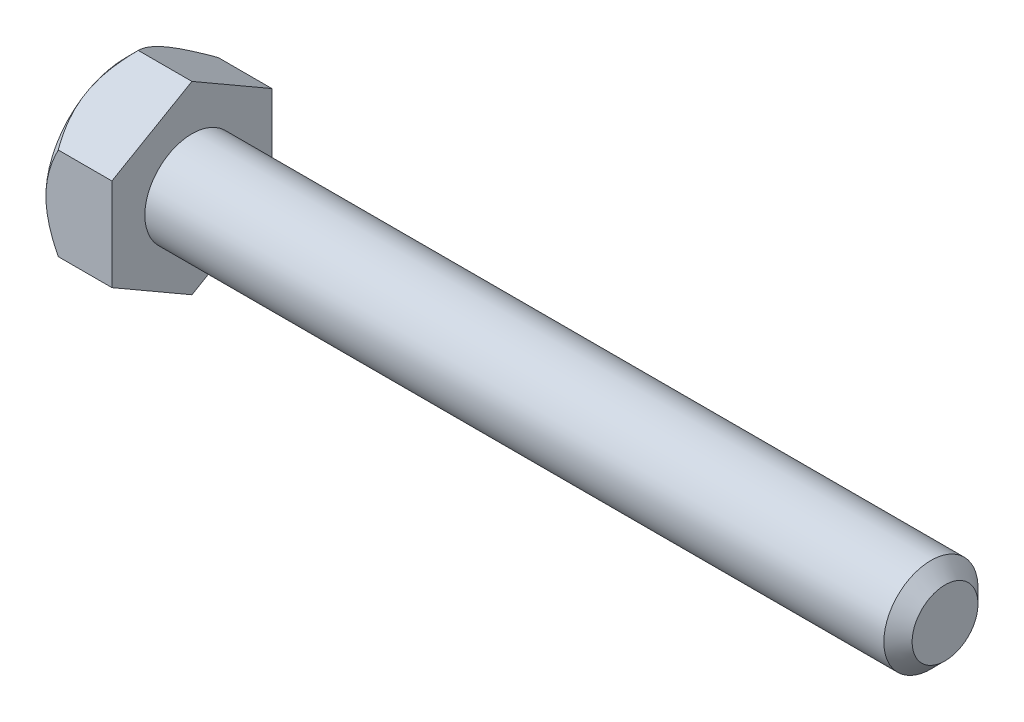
ISO-10303-21;
HEADER;
FILE_DESCRIPTION(('STEP AP214'),'2;1');
FILE_NAME('part.step','',(''),(''),'','','');
FILE_SCHEMA(('AUTOMOTIVE_DESIGN { 1 0 10303 214 1 1 1 1 }'));
ENDSEC;
DATA;
#1=APPLICATION_CONTEXT('core data for automotive mechanical design processes');
#2=APPLICATION_PROTOCOL_DEFINITION('international standard','automotive_design',2000,#1);
#3=PRODUCT_CONTEXT('',#1,'mechanical');
#4=PRODUCT('Part','Part','',(#3));
#5=PRODUCT_RELATED_PRODUCT_CATEGORY('part','',(#4));
#6=PRODUCT_DEFINITION_FORMATION('','',#4);
#7=PRODUCT_DEFINITION_CONTEXT('part definition',#1,'design');
#8=PRODUCT_DEFINITION('design','',#6,#7);
#9=PRODUCT_DEFINITION_SHAPE('','',#8);
#10=(LENGTH_UNIT() NAMED_UNIT(*) SI_UNIT(.MILLI.,.METRE.));
#11=(NAMED_UNIT(*) PLANE_ANGLE_UNIT() SI_UNIT($,.RADIAN.));
#12=(NAMED_UNIT(*) SI_UNIT($,.STERADIAN.) SOLID_ANGLE_UNIT());
#13=UNCERTAINTY_MEASURE_WITH_UNIT(LENGTH_MEASURE(1.E-05),#10,'distance_accuracy_value','');
#14=(GEOMETRIC_REPRESENTATION_CONTEXT(3) GLOBAL_UNCERTAINTY_ASSIGNED_CONTEXT((#13)) GLOBAL_UNIT_ASSIGNED_CONTEXT((#10,
#11,#12)) REPRESENTATION_CONTEXT('',''));
#15=CARTESIAN_POINT('',(0.,0.,0.));
#16=DIRECTION('',(0.,0.,1.));
#17=DIRECTION('',(1.,0.,0.));
#18=AXIS2_PLACEMENT_3D('',#15,#16,#17);
#19=CARTESIAN_POINT('',(0.,9.81499999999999,0.));
#20=DIRECTION('',(-1.,0.,0.));
#21=DIRECTION('',(0.,0.,1.));
#22=AXIS2_PLACEMENT_3D('',#19,#20,#21);
#23=PLANE('',#22);
#24=CARTESIAN_POINT('',(0.,0.,0.));
#25=DIRECTION('',(-1.,0.,0.));
#26=DIRECTION('',(0.,0.,1.));
#27=AXIS2_PLACEMENT_3D('',#24,#25,#26);
#28=CIRCLE('',#27,5.);
#29=CARTESIAN_POINT('',(0.,0.,5.00000000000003));
#30=VERTEX_POINT('',#29);
#31=EDGE_CURVE('E156',#30,#30,#28,.T.);
#32=ORIENTED_EDGE('',*,*,#31,.T.);
#33=EDGE_LOOP('',(#32));
#34=FACE_BOUND('',#33,.T.);
#35=DIRECTION('',(0.,-1.,0.));
#36=VECTOR('',#35,1.);
#37=CARTESIAN_POINT('',(0.,9.81499999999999,-8.50000000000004));
#38=LINE('',#37,#36);
#39=CARTESIAN_POINT('',(0.,4.90747728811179,-8.50000000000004));
#40=VERTEX_POINT('',#39);
#41=CARTESIAN_POINT('',(0.,-4.90747728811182,-8.50000000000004));
#42=VERTEX_POINT('',#41);
#43=EDGE_CURVE('E162',#40,#42,#38,.T.);
#44=ORIENTED_EDGE('',*,*,#43,.F.);
#45=DIRECTION('',(0.,-0.500000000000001,-0.866025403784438));
#46=VECTOR('',#45,1.);
#47=CARTESIAN_POINT('',(0.,9.81496593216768,1.96690720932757E-05));
#48=LINE('',#47,#46);
#49=CARTESIAN_POINT('',(0.,9.81495457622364,0.));
#50=VERTEX_POINT('',#49);
#51=EDGE_CURVE('E165',#50,#40,#48,.T.);
#52=ORIENTED_EDGE('',*,*,#51,.F.);
#53=DIRECTION('',(0.,0.500000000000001,-0.866025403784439));
#54=VECTOR('',#53,1.);
#55=CARTESIAN_POINT('',(0.,9.8149659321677,-1.96690721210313E-05));
#56=LINE('',#55,#54);
#57=CARTESIAN_POINT('',(0.,4.90747728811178,8.50000000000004));
#58=VERTEX_POINT('',#57);
#59=EDGE_CURVE('E169',#58,#50,#56,.T.);
#60=ORIENTED_EDGE('',*,*,#59,.F.);
#61=DIRECTION('',(0.,1.,0.));
#62=VECTOR('',#61,1.);
#63=CARTESIAN_POINT('',(0.,9.81500000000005,8.49999999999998));
#64=LINE('',#63,#62);
#65=CARTESIAN_POINT('',(0.,-4.90747728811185,8.49999999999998));
#66=VERTEX_POINT('',#65);
#67=EDGE_CURVE('E171',#66,#58,#64,.T.);
#68=ORIENTED_EDGE('',*,*,#67,.F.);
#69=DIRECTION('',(0.,0.500000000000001,0.866025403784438));
#70=VECTOR('',#69,1.);
#71=CARTESIAN_POINT('',(0.,-4.90746593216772,8.50001966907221));
#72=LINE('',#71,#70);
#73=CARTESIAN_POINT('',(0.,-9.81495457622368,0.));
#74=VERTEX_POINT('',#73);
#75=EDGE_CURVE('E173',#74,#66,#72,.T.);
#76=ORIENTED_EDGE('',*,*,#75,.F.);
#77=DIRECTION('',(0.,-0.5,0.866025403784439));
#78=VECTOR('',#77,1.);
#79=CARTESIAN_POINT('',(0.,-4.90746593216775,-8.50001966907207));
#80=LINE('',#79,#78);
#81=EDGE_CURVE('E175',#42,#74,#80,.T.);
#82=ORIENTED_EDGE('',*,*,#81,.F.);
#83=EDGE_LOOP('',(#44,#52,#60,#68,#76,#82));
#84=FACE_BOUND('',#83,.T.);
#85=ADVANCED_FACE('F31',(#34,#84),#23,.F.);
#86=CARTESIAN_POINT('',(-49.2334801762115,0.,0.));
#87=DIRECTION('',(-1.,0.,0.));
#88=DIRECTION('',(0.,0.,1.));
#89=AXIS2_PLACEMENT_3D('',#86,#87,#88);
#90=CYLINDRICAL_SURFACE('',#89,5.);
#91=CARTESIAN_POINT('',(78.5,0.,0.));
#92=DIRECTION('',(-1.,0.,0.));
#93=DIRECTION('',(0.,0.,1.));
#94=AXIS2_PLACEMENT_3D('',#91,#92,#93);
#95=CIRCLE('',#94,5.);
#96=CARTESIAN_POINT('',(78.5,0.,5.));
#97=VERTEX_POINT('',#96);
#98=EDGE_CURVE('E146',#97,#97,#95,.T.);
#99=ORIENTED_EDGE('',*,*,#98,.T.);
#100=EDGE_LOOP('',(#99));
#101=FACE_BOUND('',#100,.T.);
#102=ORIENTED_EDGE('',*,*,#31,.F.);
#103=EDGE_LOOP('',(#102));
#104=FACE_BOUND('',#103,.T.);
#105=ADVANCED_FACE('F287',(#101,#104),#90,.T.);
#106=CARTESIAN_POINT('',(80.,4.99999999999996,0.));
#107=DIRECTION('',(-1.,0.,0.));
#108=DIRECTION('',(0.,0.,1.));
#109=AXIS2_PLACEMENT_3D('',#106,#107,#108);
#110=PLANE('',#109);
#111=CARTESIAN_POINT('',(80.,0.,0.));
#112=DIRECTION('',(-1.,0.,0.));
#113=DIRECTION('',(0.,0.,1.));
#114=AXIS2_PLACEMENT_3D('',#111,#112,#113);
#115=CIRCLE('',#114,3.49999999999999);
#116=CARTESIAN_POINT('',(80.,0.,3.49999999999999));
#117=VERTEX_POINT('',#116);
#118=EDGE_CURVE('E151',#117,#117,#115,.F.);
#119=ORIENTED_EDGE('',*,*,#118,.T.);
#120=EDGE_LOOP('',(#119));
#121=FACE_BOUND('',#120,.T.);
#122=ADVANCED_FACE('F282',(#121),#110,.F.);
#123=CARTESIAN_POINT('',(78.5,0.,0.));
#124=DIRECTION('',(-1.,0.,0.));
#125=DIRECTION('',(0.,0.,1.));
#126=AXIS2_PLACEMENT_3D('',#123,#124,#125);
#127=CONICAL_SURFACE('',#126,5.,0.78539816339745);
#128=ORIENTED_EDGE('',*,*,#118,.F.);
#129=EDGE_LOOP('',(#128));
#130=FACE_BOUND('',#129,.T.);
#131=ORIENTED_EDGE('',*,*,#98,.F.);
#132=EDGE_LOOP('',(#131));
#133=FACE_BOUND('',#132,.T.);
#134=ADVANCED_FACE('F279',(#130,#133),#127,.T.);
#135=CARTESIAN_POINT('',(80.,4.90747728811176,-8.50000000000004));
#136=DIRECTION('',(0.,0.,-1.));
#137=DIRECTION('',(0.,1.,0.));
#138=AXIS2_PLACEMENT_3D('',#135,#136,#137);
#139=PLANE('',#138);
#140=ORIENTED_EDGE('',*,*,#43,.T.);
#141=DIRECTION('',(-1.,0.,0.));
#142=VECTOR('',#141,1.);
#143=CARTESIAN_POINT('',(80.,-4.90747728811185,-8.50000000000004));
#144=LINE('',#143,#142);
#145=CARTESIAN_POINT('',(-5.70004542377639,-4.90747728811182,-8.50000000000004));
#146=VERTEX_POINT('',#145);
#147=EDGE_CURVE('E53',#42,#146,#144,.T.);
#148=ORIENTED_EDGE('',*,*,#147,.T.);
#149=CARTESIAN_POINT('',(-2.20099238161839,-10.2475752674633,-8.50000000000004));
#150=CARTESIAN_POINT('',(-2.39148729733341,-10.0000220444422,-8.50000000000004));
#151=CARTESIAN_POINT('',(-2.58027693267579,-9.75113564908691,-8.50000000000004));
#152=CARTESIAN_POINT('',(-2.95366635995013,-9.25015135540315,-8.50000000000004));
#153=CARTESIAN_POINT('',(-3.13826515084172,-8.9980527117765,-8.50000000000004));
#154=CARTESIAN_POINT('',(-3.50380727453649,-8.48825657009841,-8.50000000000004));
#155=CARTESIAN_POINT('',(-3.6847114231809,-8.23053088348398,-8.50000000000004));
#156=CARTESIAN_POINT('',(-4.0402299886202,-7.71079138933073,-8.50000000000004));
#157=CARTESIAN_POINT('',(-4.21484483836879,-7.44877787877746,-8.50000000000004));
#158=CARTESIAN_POINT('',(-4.56719352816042,-6.90294553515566,-8.50000000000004));
#159=CARTESIAN_POINT('',(-4.74442147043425,-6.61879848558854,-8.50000000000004));
#160=CARTESIAN_POINT('',(-5.08788546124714,-6.04383123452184,-8.50000000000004));
#161=CARTESIAN_POINT('',(-5.25411965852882,-5.75300992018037,-8.50000000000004));
#162=CARTESIAN_POINT('',(-5.57205660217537,-5.16461318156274,-8.50000000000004));
#163=CARTESIAN_POINT('',(-5.72380200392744,-4.86706098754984,-8.50000000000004));
#164=CARTESIAN_POINT('',(-6.00936151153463,-4.26354131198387,-8.50000000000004));
#165=CARTESIAN_POINT('',(-6.143184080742,-3.95757788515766,-8.50000000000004));
#166=CARTESIAN_POINT('',(-6.37593531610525,-3.36727774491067,-8.50000000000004));
#167=CARTESIAN_POINT('',(-6.4770059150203,-3.08379425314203,-8.50000000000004));
#168=CARTESIAN_POINT('',(-6.65645652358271,-2.50959977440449,-8.50000000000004));
#169=CARTESIAN_POINT('',(-6.73483508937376,-2.21888832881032,-8.50000000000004));
#170=CARTESIAN_POINT('',(-6.86335051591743,-1.63704047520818,-8.50000000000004));
#171=CARTESIAN_POINT('',(-6.91400071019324,-1.34601938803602,-8.50000000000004));
#172=CARTESIAN_POINT('',(-6.9860018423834,-0.760354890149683,-8.50000000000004));
#173=CARTESIAN_POINT('',(-7.00735887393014,-0.465712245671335,-8.50000000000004));
#174=CARTESIAN_POINT('',(-7.01895139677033,0.111271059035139,-8.50000000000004));
#175=CARTESIAN_POINT('',(-7.01050879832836,0.39358540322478,-8.50000000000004));
#176=CARTESIAN_POINT('',(-6.96600422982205,0.95601376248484,-8.50000000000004));
#177=CARTESIAN_POINT('',(-6.9299397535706,1.23612757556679,-8.50000000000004));
#178=CARTESIAN_POINT('',(-6.83161857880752,1.79687506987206,-8.50000000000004));
#179=CARTESIAN_POINT('',(-6.76889922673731,2.07742624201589,-8.50000000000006));
#180=CARTESIAN_POINT('',(-6.62074968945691,2.63234937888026,-8.50000000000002));
#181=CARTESIAN_POINT('',(-6.53532078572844,2.90672169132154,-8.49999999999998));
#182=CARTESIAN_POINT('',(-6.34007948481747,3.46428363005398,-8.49999999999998));
#183=CARTESIAN_POINT('',(-6.22915048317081,3.74707777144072,-8.50000000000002));
#184=CARTESIAN_POINT('',(-5.99015355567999,4.30539281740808,-8.50000000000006));
#185=CARTESIAN_POINT('',(-5.86207790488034,4.58091037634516,-8.50000000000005));
#186=CARTESIAN_POINT('',(-5.59182487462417,5.125972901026,-8.50000000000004));
#187=CARTESIAN_POINT('',(-5.44960407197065,5.39549616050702,-8.50000000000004));
#188=CARTESIAN_POINT('',(-5.15419030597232,5.92836696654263,-8.50000000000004));
#189=CARTESIAN_POINT('',(-5.00099903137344,6.19171545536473,-8.50000000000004));
#190=CARTESIAN_POINT('',(-4.69356806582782,6.70017362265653,-8.50000000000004));
#191=CARTESIAN_POINT('',(-4.5397536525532,6.94554180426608,-8.50000000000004));
#192=CARTESIAN_POINT('',(-4.22557688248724,7.43206252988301,-8.50000000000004));
#193=CARTESIAN_POINT('',(-4.06521403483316,7.67321475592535,-8.50000000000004));
#194=CARTESIAN_POINT('',(-3.74041338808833,8.14991649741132,-8.50000000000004));
#195=CARTESIAN_POINT('',(-3.57601863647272,8.38549544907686,-8.50000000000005));
#196=CARTESIAN_POINT('',(-3.24282166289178,8.85342140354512,-8.50000000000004));
#197=CARTESIAN_POINT('',(-3.07402066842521,9.08576927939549,-8.50000000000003));
#198=CARTESIAN_POINT('',(-2.90341606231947,9.3167617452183,-8.50000000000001));
#199=B_SPLINE_CURVE_WITH_KNOTS('',3,(#149,#150,#151,#152,#153,#154,#155,#156,#157,#158,#159,
#160,#161,#162,#163,#164,#165,#166,#167,#168,#169,#170,#171,#172,#173,#174,#175,#176,#177,#178,
#179,#180,#181,#182,#183,#184,#185,#186,#187,#188,#189,#190,#191,#192,#193,#194,#195,#196,#197,
#198),.UNSPECIFIED.,.F.,.F.,(4,2,2,2,2,2,2,2,2,2,2,2,2,2,2,2,2,2,2,2,2,2,2,2,4),(0.,
0.93710745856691,1.87443645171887,2.81899618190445,3.76349076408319,4.76795395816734,
5.7725858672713,6.77416250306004,7.77526450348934,8.67737267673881,9.57953823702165,
10.4643827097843,11.3490430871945,12.1949626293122,13.0409589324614,13.9022810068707,
14.7635544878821,15.6741741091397,16.5852053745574,17.4991251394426,18.4129045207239,
19.2815633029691,20.1502873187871,21.0120374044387,21.8735499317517),.UNSPECIFIED.);
#200=CARTESIAN_POINT('',(-7.00000000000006,-0.505197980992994,-8.50000000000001));
#201=VERTEX_POINT('',#200);
#202=EDGE_CURVE('E46',#201,#146,#199,.F.);
#203=ORIENTED_EDGE('',*,*,#202,.F.);
#204=DIRECTION('',(0.,-1.,0.));
#205=VECTOR('',#204,1.);
#206=CARTESIAN_POINT('',(-7.00000000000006,4.90747728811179,-8.50000000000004));
#207=LINE('',#206,#205);
#208=CARTESIAN_POINT('',(-7.00000000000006,0.505197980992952,-8.50000000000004));
#209=VERTEX_POINT('',#208);
#210=EDGE_CURVE('E135',#209,#201,#207,.T.);
#211=ORIENTED_EDGE('',*,*,#210,.F.);
#212=CARTESIAN_POINT('',(-5.70004542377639,4.90747728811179,-8.50000000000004));
#213=VERTEX_POINT('',#212);
#214=EDGE_CURVE('E11',#213,#209,#199,.F.);
#215=ORIENTED_EDGE('',*,*,#214,.F.);
#216=DIRECTION('',(-1.,0.,0.));
#217=VECTOR('',#216,1.);
#218=CARTESIAN_POINT('',(80.,4.90747728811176,-8.50000000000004));
#219=LINE('',#218,#217);
#220=EDGE_CURVE('E177',#40,#213,#219,.T.);
#221=ORIENTED_EDGE('',*,*,#220,.F.);
#222=EDGE_LOOP('',(#140,#148,#203,#211,#215,#221));
#223=FACE_BOUND('',#222,.T.);
#224=ADVANCED_FACE('F276',(#223),#139,.T.);
#225=CARTESIAN_POINT('',(80.,4.90747728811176,-8.50000000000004));
#226=DIRECTION('',(0.,0.866025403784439,-0.5));
#227=DIRECTION('',(0.,0.500000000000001,0.866025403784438));
#228=AXIS2_PLACEMENT_3D('',#225,#226,#227);
#229=PLANE('',#228);
#230=ORIENTED_EDGE('',*,*,#51,.T.);
#231=ORIENTED_EDGE('',*,*,#220,.T.);
#232=CARTESIAN_POINT('',(-7.00020000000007,7.11030806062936,-4.6845851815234));
#233=CARTESIAN_POINT('',(-6.99212333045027,7.04164938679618,-4.8035054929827));
#234=CARTESIAN_POINT('',(-6.98071689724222,6.97309461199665,-4.92224584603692));
#235=CARTESIAN_POINT('',(-6.95149887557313,6.83634416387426,-5.1591045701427));
#236=CARTESIAN_POINT('',(-6.93368893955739,6.76814840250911,-5.27722309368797));
#237=CARTESIAN_POINT('',(-6.89195532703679,6.63236665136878,-5.51240398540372));
#238=CARTESIAN_POINT('',(-6.8680438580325,6.56477971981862,-5.62946798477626));
#239=CARTESIAN_POINT('',(-6.81443200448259,6.43018335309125,-5.86259573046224));
#240=CARTESIAN_POINT('',(-6.78473127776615,6.36317395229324,-5.97865941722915));
#241=CARTESIAN_POINT('',(-6.68832680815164,6.16483001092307,-6.32220120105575));
#242=CARTESIAN_POINT('',(-6.61376611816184,6.03443719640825,-6.54804818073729));
#243=CARTESIAN_POINT('',(-6.44666154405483,5.77657190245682,-6.99468397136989));
#244=CARTESIAN_POINT('',(-6.35411172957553,5.64910040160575,-7.21547108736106));
#245=CARTESIAN_POINT('',(-6.1712481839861,5.41876984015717,-7.61441532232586));
#246=CARTESIAN_POINT('',(-6.0832769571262,5.31544149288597,-7.79338526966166));
#247=CARTESIAN_POINT('',(-5.94454138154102,5.16166450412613,-8.05973482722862));
#248=CARTESIAN_POINT('',(-5.89703134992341,5.11047399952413,-8.14839938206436));
#249=CARTESIAN_POINT('',(-5.79996852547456,5.00856526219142,-8.32491049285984));
#250=CARTESIAN_POINT('',(-5.75041528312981,4.9578471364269,-8.41275686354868));
#251=CARTESIAN_POINT('',(-5.69992995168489,4.90736181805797,-8.50020000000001));
#252=B_SPLINE_CURVE_WITH_KNOTS('',3,(#232,#233,#234,#235,#236,#237,#238,#239,#240,#241,#242,
#243,#244,#245,#246,#247,#248,#249,#250,#251),.UNSPECIFIED.,.F.,.F.,(4,2,2,2,2,2,2,2,2,4),(0.,
0.412606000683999,0.825105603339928,1.23678629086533,1.64849131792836,2.46134747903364,
3.27447206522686,3.94803852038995,4.28662200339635,4.62528037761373),.UNSPECIFIED.);
#253=CARTESIAN_POINT('',(-7.00000000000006,7.10861694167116,-4.68751428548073));
#254=VERTEX_POINT('',#253);
#255=EDGE_CURVE('E35',#254,#213,#252,.T.);
#256=ORIENTED_EDGE('',*,*,#255,.F.);
#257=DIRECTION('',(0.,-0.500000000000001,-0.866025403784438));
#258=VECTOR('',#257,1.);
#259=CARTESIAN_POINT('',(-7.00000000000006,4.90747728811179,-8.50000000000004));
#260=LINE('',#259,#258);
#261=CARTESIAN_POINT('',(-7.00000000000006,7.6138149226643,-3.81248571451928));
#262=VERTEX_POINT('',#261);
#263=EDGE_CURVE('E179',#262,#254,#260,.T.);
#264=ORIENTED_EDGE('',*,*,#263,.F.);
#265=CARTESIAN_POINT('',(-5.69992995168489,9.81507004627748,0.000200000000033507));
#266=CARTESIAN_POINT('',(-5.77229267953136,9.74270188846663,-0.125145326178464));
#267=CARTESIAN_POINT('',(-5.84274611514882,9.66985808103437,-0.25131450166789));
#268=CARTESIAN_POINT('',(-5.97934353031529,9.52313918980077,-0.505439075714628));
#269=CARTESIAN_POINT('',(-6.04548607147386,9.44926377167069,-0.633395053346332));
#270=CARTESIAN_POINT('',(-6.23712552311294,9.22547575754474,-1.02100726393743));
#271=CARTESIAN_POINT('',(-6.35527482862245,9.07395201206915,-1.2834540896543));
#272=CARTESIAN_POINT('',(-6.56478037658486,8.76978316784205,-1.81028998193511));
#273=CARTESIAN_POINT('',(-6.65663760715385,8.6172251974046,-2.07452813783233));
#274=CARTESIAN_POINT('',(-6.81143560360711,8.30868539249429,-2.60893475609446));
#275=CARTESIAN_POINT('',(-6.87443250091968,8.15271082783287,-2.8790906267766));
#276=CARTESIAN_POINT('',(-6.93957976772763,7.93210564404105,-3.26119001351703));
#277=CARTESIAN_POINT('',(-6.95561418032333,7.86845847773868,-3.37143013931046));
#278=CARTESIAN_POINT('',(-6.98214962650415,7.74061571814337,-3.5928602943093));
#279=CARTESIAN_POINT('',(-6.99262792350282,7.67641894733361,-3.70405236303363));
#280=CARTESIAN_POINT('',(-7.00020000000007,7.61212380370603,-3.81541481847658));
#281=B_SPLINE_CURVE_WITH_KNOTS('',3,(#265,#266,#267,#268,#269,#270,#271,#272,#273,#274,#275,
#276,#277,#278,#279,#280),.UNSPECIFIED.,.F.,.F.,(4,2,2,2,2,2,2,4),(0.,0.485424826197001,
0.971010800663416,1.94588199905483,2.90070690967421,3.85366678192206,4.23846330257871,
4.62482255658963),.UNSPECIFIED.);
#282=CARTESIAN_POINT('',(-5.70004542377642,9.81495457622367,0.));
#283=VERTEX_POINT('',#282);
#284=EDGE_CURVE('E225',#283,#262,#281,.T.);
#285=ORIENTED_EDGE('',*,*,#284,.F.);
#286=DIRECTION('',(-1.,0.,0.));
#287=VECTOR('',#286,1.);
#288=CARTESIAN_POINT('',(80.,9.81495457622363,0.));
#289=LINE('',#288,#287);
#290=EDGE_CURVE('E187',#50,#283,#289,.T.);
#291=ORIENTED_EDGE('',*,*,#290,.F.);
#292=EDGE_LOOP('',(#230,#231,#256,#264,#285,#291));
#293=FACE_BOUND('',#292,.T.);
#294=ADVANCED_FACE('F248',(#293),#229,.T.);
#295=CARTESIAN_POINT('',(80.,9.81495457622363,0.));
#296=DIRECTION('',(0.,0.866025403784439,0.5));
#297=DIRECTION('',(0.,-0.500000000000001,0.866025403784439));
#298=AXIS2_PLACEMENT_3D('',#295,#296,#297);
#299=PLANE('',#298);
#300=ORIENTED_EDGE('',*,*,#59,.T.);
#301=ORIENTED_EDGE('',*,*,#290,.T.);
#302=CARTESIAN_POINT('',(-7.00020000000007,7.61212380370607,3.81541481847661));
#303=CARTESIAN_POINT('',(-6.99212333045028,7.6807824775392,3.69649450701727));
#304=CARTESIAN_POINT('',(-6.98071689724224,7.74933725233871,3.57775415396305));
#305=CARTESIAN_POINT('',(-6.95149887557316,7.8860877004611,3.34089542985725));
#306=CARTESIAN_POINT('',(-6.93368893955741,7.95428346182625,3.22277690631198));
#307=CARTESIAN_POINT('',(-6.89195532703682,8.09006521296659,2.98759601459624));
#308=CARTESIAN_POINT('',(-6.86804385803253,8.15765214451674,2.87053201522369));
#309=CARTESIAN_POINT('',(-6.81443200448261,8.29224851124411,2.63740426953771));
#310=CARTESIAN_POINT('',(-6.78473127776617,8.35925791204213,2.5213405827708));
#311=CARTESIAN_POINT('',(-6.68832680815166,8.5576018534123,2.1777987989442));
#312=CARTESIAN_POINT('',(-6.61376611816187,8.6879946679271,1.95195181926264));
#313=CARTESIAN_POINT('',(-6.44666154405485,8.94585996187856,1.50531602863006));
#314=CARTESIAN_POINT('',(-6.35411172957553,9.07333146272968,1.28452891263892));
#315=CARTESIAN_POINT('',(-6.17124818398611,9.30366202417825,0.885584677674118));
#316=CARTESIAN_POINT('',(-6.08327695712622,9.40699037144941,0.706614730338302));
#317=CARTESIAN_POINT('',(-5.94454138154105,9.56076736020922,0.440265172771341));
#318=CARTESIAN_POINT('',(-5.89703134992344,9.61195786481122,0.351600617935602));
#319=CARTESIAN_POINT('',(-5.79996852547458,9.71386660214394,0.175089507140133));
#320=CARTESIAN_POINT('',(-5.75041528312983,9.76458472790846,0.087243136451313));
#321=CARTESIAN_POINT('',(-5.69992995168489,9.81507004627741,-0.000200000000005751));
#322=B_SPLINE_CURVE_WITH_KNOTS('',3,(#302,#303,#304,#305,#306,#307,#308,#309,#310,#311,#312,
#313,#314,#315,#316,#317,#318,#319,#320,#321),.UNSPECIFIED.,.F.,.F.,(4,2,2,2,2,2,2,2,2,4),(0.,
0.412606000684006,0.825105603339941,1.23678629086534,1.64849131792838,2.46134747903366,
3.27447206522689,3.94803852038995,4.28662200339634,4.62528037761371),.UNSPECIFIED.);
#323=CARTESIAN_POINT('',(-7.00000000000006,7.61381492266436,3.81248571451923));
#324=VERTEX_POINT('',#323);
#325=EDGE_CURVE('E222',#324,#283,#322,.T.);
#326=ORIENTED_EDGE('',*,*,#325,.F.);
#327=DIRECTION('',(0.,0.5,-0.866025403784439));
#328=VECTOR('',#327,1.);
#329=CARTESIAN_POINT('',(-7.00000000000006,9.81495457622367,0.));
#330=LINE('',#329,#328);
#331=CARTESIAN_POINT('',(-7.00000000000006,7.10861694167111,4.68751428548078));
#332=VERTEX_POINT('',#331);
#333=EDGE_CURVE('E193',#332,#324,#330,.T.);
#334=ORIENTED_EDGE('',*,*,#333,.F.);
#335=CARTESIAN_POINT('',(-5.69992995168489,4.90736181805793,8.50020000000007));
#336=CARTESIAN_POINT('',(-5.77229267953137,4.97972997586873,8.37485467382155));
#337=CARTESIAN_POINT('',(-5.84274611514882,5.05257378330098,8.2486854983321));
#338=CARTESIAN_POINT('',(-5.9793435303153,5.19929267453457,7.99456092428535));
#339=CARTESIAN_POINT('',(-6.04548607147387,5.27316809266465,7.86660494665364));
#340=CARTESIAN_POINT('',(-6.23712552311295,5.49695610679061,7.47899273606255));
#341=CARTESIAN_POINT('',(-6.35527482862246,5.64847985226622,7.21654591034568));
#342=CARTESIAN_POINT('',(-6.56478037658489,5.9526486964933,6.68971001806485));
#343=CARTESIAN_POINT('',(-6.65663760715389,6.10520666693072,6.42547186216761));
#344=CARTESIAN_POINT('',(-6.81143560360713,6.41374647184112,5.8910652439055));
#345=CARTESIAN_POINT('',(-6.87443250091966,6.56972103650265,5.62090937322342));
#346=CARTESIAN_POINT('',(-6.93957976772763,6.7903262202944,5.23880998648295));
#347=CARTESIAN_POINT('',(-6.95561418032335,6.85397338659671,5.1285698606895));
#348=CARTESIAN_POINT('',(-6.98214962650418,6.98181614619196,4.90713970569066));
#349=CARTESIAN_POINT('',(-6.99262792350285,7.04601291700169,4.79594763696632));
#350=CARTESIAN_POINT('',(-7.00020000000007,7.1103080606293,4.6845851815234));
#351=B_SPLINE_CURVE_WITH_KNOTS('',3,(#335,#336,#337,#338,#339,#340,#341,#342,#343,#344,#345,
#346,#347,#348,#349,#350),.UNSPECIFIED.,.F.,.F.,(4,2,2,2,2,2,2,4),(0.,0.485424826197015,
0.971010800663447,1.94588199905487,2.90070690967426,3.85366678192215,4.23846330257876,
4.62482255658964),.UNSPECIFIED.);
#352=CARTESIAN_POINT('',(-5.70004542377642,4.90747728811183,8.50000000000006));
#353=VERTEX_POINT('',#352);
#354=EDGE_CURVE('E219',#353,#332,#351,.T.);
#355=ORIENTED_EDGE('',*,*,#354,.F.);
#356=DIRECTION('',(-1.,0.,0.));
#357=VECTOR('',#356,1.);
#358=CARTESIAN_POINT('',(80.,4.90747728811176,8.50000000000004));
#359=LINE('',#358,#357);
#360=EDGE_CURVE('E184',#58,#353,#359,.T.);
#361=ORIENTED_EDGE('',*,*,#360,.F.);
#362=EDGE_LOOP('',(#300,#301,#326,#334,#355,#361));
#363=FACE_BOUND('',#362,.T.);
#364=ADVANCED_FACE('F244',(#363),#299,.T.);
#365=CARTESIAN_POINT('',(80.,4.90747728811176,8.50000000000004));
#366=DIRECTION('',(0.,0.,1.));
#367=DIRECTION('',(0.,-1.,0.));
#368=AXIS2_PLACEMENT_3D('',#365,#366,#367);
#369=PLANE('',#368);
#370=ORIENTED_EDGE('',*,*,#67,.T.);
#371=ORIENTED_EDGE('',*,*,#360,.T.);
#372=CARTESIAN_POINT('',(-2.20099238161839,-10.2475752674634,8.50000000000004));
#373=CARTESIAN_POINT('',(-2.39148729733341,-10.0000220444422,8.50000000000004));
#374=CARTESIAN_POINT('',(-2.5802769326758,-9.75113564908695,8.50000000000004));
#375=CARTESIAN_POINT('',(-2.95366635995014,-9.25015135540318,8.50000000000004));
#376=CARTESIAN_POINT('',(-3.13826515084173,-8.99805271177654,8.50000000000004));
#377=CARTESIAN_POINT('',(-3.5038072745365,-8.48825657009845,8.50000000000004));
#378=CARTESIAN_POINT('',(-3.68471142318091,-8.23053088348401,8.50000000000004));
#379=CARTESIAN_POINT('',(-4.04022998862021,-7.71079138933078,8.50000000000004));
#380=CARTESIAN_POINT('',(-4.21484483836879,-7.44877787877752,8.50000000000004));
#381=CARTESIAN_POINT('',(-4.56719352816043,-6.90294553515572,8.50000000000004));
#382=CARTESIAN_POINT('',(-4.74442147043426,-6.61879848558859,8.50000000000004));
#383=CARTESIAN_POINT('',(-5.08788546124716,-6.0438312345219,8.50000000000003));
#384=CARTESIAN_POINT('',(-5.25411965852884,-5.75300992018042,8.50000000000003));
#385=CARTESIAN_POINT('',(-5.57205660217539,-5.16461318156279,8.50000000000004));
#386=CARTESIAN_POINT('',(-5.72380200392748,-4.86706098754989,8.50000000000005));
#387=CARTESIAN_POINT('',(-6.00936151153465,-4.26354131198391,8.50000000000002));
#388=CARTESIAN_POINT('',(-6.14318408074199,-3.95757788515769,8.49999999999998));
#389=CARTESIAN_POINT('',(-6.37593531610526,-3.3672777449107,8.49999999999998));
#390=CARTESIAN_POINT('',(-6.47700591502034,-3.08379425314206,8.50000000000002));
#391=CARTESIAN_POINT('',(-6.65645652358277,-2.50959977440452,8.50000000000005));
#392=CARTESIAN_POINT('',(-6.73483508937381,-2.21888832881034,8.50000000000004));
#393=CARTESIAN_POINT('',(-6.86335051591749,-1.6370404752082,8.50000000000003));
#394=CARTESIAN_POINT('',(-6.91400071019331,-1.34601938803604,8.50000000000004));
#395=CARTESIAN_POINT('',(-6.98600184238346,-0.760354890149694,8.50000000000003));
#396=CARTESIAN_POINT('',(-7.00735887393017,-0.46571224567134,8.50000000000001));
#397=CARTESIAN_POINT('',(-7.01895139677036,0.111271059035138,8.50000000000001));
#398=CARTESIAN_POINT('',(-7.01050879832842,0.393585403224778,8.50000000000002));
#399=CARTESIAN_POINT('',(-6.96600422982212,0.956013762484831,8.50000000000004));
#400=CARTESIAN_POINT('',(-6.92993975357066,1.23612757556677,8.50000000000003));
#401=CARTESIAN_POINT('',(-6.83161857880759,1.79687506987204,8.50000000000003));
#402=CARTESIAN_POINT('',(-6.7688992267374,2.07742624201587,8.50000000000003));
#403=CARTESIAN_POINT('',(-6.62074968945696,2.63234937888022,8.50000000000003));
#404=CARTESIAN_POINT('',(-6.53532078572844,2.90672169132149,8.50000000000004));
#405=CARTESIAN_POINT('',(-6.34007948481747,3.46428363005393,8.50000000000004));
#406=CARTESIAN_POINT('',(-6.22915048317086,3.74707777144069,8.50000000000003));
#407=CARTESIAN_POINT('',(-5.99015355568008,4.30539281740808,8.50000000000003));
#408=CARTESIAN_POINT('',(-5.86207790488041,4.58091037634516,8.50000000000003));
#409=CARTESIAN_POINT('',(-5.59182487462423,5.125972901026,8.50000000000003));
#410=CARTESIAN_POINT('',(-5.44960407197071,5.39549616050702,8.50000000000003));
#411=CARTESIAN_POINT('',(-5.15419030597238,5.92836696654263,8.50000000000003));
#412=CARTESIAN_POINT('',(-5.0009990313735,6.19171545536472,8.50000000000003));
#413=CARTESIAN_POINT('',(-4.69356806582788,6.70017362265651,8.50000000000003));
#414=CARTESIAN_POINT('',(-4.53975365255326,6.94554180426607,8.50000000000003));
#415=CARTESIAN_POINT('',(-4.22557688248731,7.43206252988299,8.50000000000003));
#416=CARTESIAN_POINT('',(-4.06521403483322,7.67321475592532,8.50000000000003));
#417=CARTESIAN_POINT('',(-3.7404133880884,8.14991649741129,8.50000000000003));
#418=CARTESIAN_POINT('',(-3.57601863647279,8.38549544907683,8.50000000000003));
#419=CARTESIAN_POINT('',(-3.24282166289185,8.85342140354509,8.50000000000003));
#420=CARTESIAN_POINT('',(-3.07402066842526,9.08576927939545,8.50000000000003));
#421=CARTESIAN_POINT('',(-2.9034160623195,9.31676174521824,8.50000000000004));
#422=B_SPLINE_CURVE_WITH_KNOTS('',3,(#372,#373,#374,#375,#376,#377,#378,#379,#380,#381,#382,
#383,#384,#385,#386,#387,#388,#389,#390,#391,#392,#393,#394,#395,#396,#397,#398,#399,#400,#401,
#402,#403,#404,#405,#406,#407,#408,#409,#410,#411,#412,#413,#414,#415,#416,#417,#418,#419,#420,
#421),.UNSPECIFIED.,.F.,.F.,(4,2,2,2,2,2,2,2,2,2,2,2,2,2,2,2,2,2,2,2,2,2,2,2,4),(0.,
0.937107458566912,1.87443645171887,2.81899618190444,3.76349076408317,4.76795395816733,
5.77258586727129,6.77416250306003,7.77526450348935,8.67737267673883,9.57953823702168,
10.4643827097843,11.3490430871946,12.1949626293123,13.0409589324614,13.9022810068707,
14.7635544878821,15.6741741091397,16.5852053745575,17.4991251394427,18.412904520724,
19.2815633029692,20.1502873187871,21.0120374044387,21.8735499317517),.UNSPECIFIED.);
#423=CARTESIAN_POINT('',(-7.00000000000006,0.505197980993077,8.50000000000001));
#424=VERTEX_POINT('',#423);
#425=EDGE_CURVE('E218',#424,#353,#422,.T.);
#426=ORIENTED_EDGE('',*,*,#425,.F.);
#427=DIRECTION('',(0.,1.,0.));
#428=VECTOR('',#427,1.);
#429=CARTESIAN_POINT('',(-7.00000000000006,4.90747728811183,8.50000000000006));
#430=LINE('',#429,#428);
#431=CARTESIAN_POINT('',(-7.00000000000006,-0.505197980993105,8.50000000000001));
#432=VERTEX_POINT('',#431);
#433=EDGE_CURVE('E196',#432,#424,#430,.T.);
#434=ORIENTED_EDGE('',*,*,#433,.F.);
#435=CARTESIAN_POINT('',(-5.70004542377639,-4.90747728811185,8.49999999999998));
#436=VERTEX_POINT('',#435);
#437=EDGE_CURVE('E210',#436,#432,#422,.T.);
#438=ORIENTED_EDGE('',*,*,#437,.F.);
#439=DIRECTION('',(-1.,0.,0.));
#440=VECTOR('',#439,1.);
#441=CARTESIAN_POINT('',(80.,-4.9074772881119,8.50000000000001));
#442=LINE('',#441,#440);
#443=EDGE_CURVE('E181',#66,#436,#442,.T.);
#444=ORIENTED_EDGE('',*,*,#443,.F.);
#445=EDGE_LOOP('',(#370,#371,#426,#434,#438,#444));
#446=FACE_BOUND('',#445,.T.);
#447=ADVANCED_FACE('F247',(#446),#369,.T.);
#448=CARTESIAN_POINT('',(80.,-9.81495457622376,0.));
#449=DIRECTION('',(0.,-0.866025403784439,0.5));
#450=DIRECTION('',(0.,-0.500000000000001,-0.866025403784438));
#451=AXIS2_PLACEMENT_3D('',#448,#449,#450);
#452=PLANE('',#451);
#453=ORIENTED_EDGE('',*,*,#75,.T.);
#454=ORIENTED_EDGE('',*,*,#443,.T.);
#455=CARTESIAN_POINT('',(-7.00020000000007,-7.11030806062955,4.68458518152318));
#456=CARTESIAN_POINT('',(-6.9921233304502,-7.04164938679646,4.80350549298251));
#457=CARTESIAN_POINT('',(-6.98071689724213,-6.97309461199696,4.92224584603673));
#458=CARTESIAN_POINT('',(-6.95149887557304,-6.83634416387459,5.15910457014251));
#459=CARTESIAN_POINT('',(-6.9336889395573,-6.76814840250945,5.27722309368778));
#460=CARTESIAN_POINT('',(-6.89195532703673,-6.63236665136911,5.51240398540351));
#461=CARTESIAN_POINT('',(-6.86804385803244,-6.56477971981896,5.62946798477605));
#462=CARTESIAN_POINT('',(-6.81443200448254,-6.43018335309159,5.86259573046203));
#463=CARTESIAN_POINT('',(-6.78473127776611,-6.36317395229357,5.97865941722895));
#464=CARTESIAN_POINT('',(-6.68832680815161,-6.16483001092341,6.32220120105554));
#465=CARTESIAN_POINT('',(-6.61376611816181,-6.03443719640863,6.54804818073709));
#466=CARTESIAN_POINT('',(-6.44666154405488,-5.77657190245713,6.99468397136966));
#467=CARTESIAN_POINT('',(-6.35411172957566,-5.64910040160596,7.21547108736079));
#468=CARTESIAN_POINT('',(-6.17124818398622,-5.41876984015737,7.61441532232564));
#469=CARTESIAN_POINT('',(-6.08327695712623,-5.31544149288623,7.79338526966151));
#470=CARTESIAN_POINT('',(-5.94454138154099,-5.1616645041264,8.05973482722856));
#471=CARTESIAN_POINT('',(-5.89703134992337,-5.11047399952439,8.14839938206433));
#472=CARTESIAN_POINT('',(-5.79996852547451,-5.0085652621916,8.32491049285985));
#473=CARTESIAN_POINT('',(-5.75041528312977,-4.95784713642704,8.4127568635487));
#474=CARTESIAN_POINT('',(-5.69992995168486,-4.90736181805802,8.50020000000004));
#475=B_SPLINE_CURVE_WITH_KNOTS('',3,(#455,#456,#457,#458,#459,#460,#461,#462,#463,#464,#465,
#466,#467,#468,#469,#470,#471,#472,#473,#474),.UNSPECIFIED.,.F.,.F.,(4,2,2,2,2,2,2,2,2,4),(0.,
0.412606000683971,0.825105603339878,1.23678629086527,1.6484913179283,2.46134747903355,
3.27447206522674,3.94803852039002,4.28662200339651,4.62528037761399),.UNSPECIFIED.);
#476=CARTESIAN_POINT('',(-7.00000000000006,-7.10861694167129,4.6875142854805));
#477=VERTEX_POINT('',#476);
#478=EDGE_CURVE('E209',#477,#436,#475,.T.);
#479=ORIENTED_EDGE('',*,*,#478,.F.);
#480=DIRECTION('',(0.,0.500000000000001,0.866025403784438));
#481=VECTOR('',#480,1.);
#482=CARTESIAN_POINT('',(-7.00000000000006,-9.81495457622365,0.));
#483=LINE('',#482,#481);
#484=CARTESIAN_POINT('',(-7.00000000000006,-7.61381492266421,3.8124857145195));
#485=VERTEX_POINT('',#484);
#486=EDGE_CURVE('E134',#485,#477,#483,.T.);
#487=ORIENTED_EDGE('',*,*,#486,.F.);
#488=CARTESIAN_POINT('',(-5.69992995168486,-9.81507004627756,-0.000200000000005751));
#489=CARTESIAN_POINT('',(-5.77229267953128,-9.74270188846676,0.125145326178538));
#490=CARTESIAN_POINT('',(-5.8427461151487,-9.66985808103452,0.251314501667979));
#491=CARTESIAN_POINT('',(-5.97934353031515,-9.52313918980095,0.505439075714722));
#492=CARTESIAN_POINT('',(-6.04548607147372,-9.44926377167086,0.633395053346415));
#493=CARTESIAN_POINT('',(-6.23712552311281,-9.2254757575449,1.0210072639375));
#494=CARTESIAN_POINT('',(-6.35527482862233,-9.07395201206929,1.28345408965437));
#495=CARTESIAN_POINT('',(-6.56478037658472,-8.76978316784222,1.81028998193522));
#496=CARTESIAN_POINT('',(-6.65663760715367,-8.61722519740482,2.07452813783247));
#497=CARTESIAN_POINT('',(-6.81143560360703,-8.3086853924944,2.60893475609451));
#498=CARTESIAN_POINT('',(-6.87443250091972,-8.15271082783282,2.87909062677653));
#499=CARTESIAN_POINT('',(-6.93957976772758,-7.9321056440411,3.26119001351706));
#500=CARTESIAN_POINT('',(-6.95561418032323,-7.86845847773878,3.37143013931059));
#501=CARTESIAN_POINT('',(-6.98214962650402,-7.74061571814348,3.59286029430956));
#502=CARTESIAN_POINT('',(-6.9926279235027,-7.67641894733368,3.70405236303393));
#503=CARTESIAN_POINT('',(-7.00020000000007,-7.61212380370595,3.81541481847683));
#504=B_SPLINE_CURVE_WITH_KNOTS('',3,(#488,#489,#490,#491,#492,#493,#494,#495,#496,#497,#498,
#499,#500,#501,#502,#503),.UNSPECIFIED.,.F.,.F.,(4,2,2,2,2,2,2,4),(0.,0.485424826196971,
0.971010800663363,1.9458819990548,2.90070690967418,3.85366678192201,4.2384633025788,
4.62482255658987),.UNSPECIFIED.);
#505=CARTESIAN_POINT('',(-5.70004542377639,-9.81495457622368,0.));
#506=VERTEX_POINT('',#505);
#507=EDGE_CURVE('E142',#506,#485,#504,.T.);
#508=ORIENTED_EDGE('',*,*,#507,.F.);
#509=DIRECTION('',(-1.,0.,0.));
#510=VECTOR('',#509,1.);
#511=CARTESIAN_POINT('',(80.,-9.81495457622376,0.));
#512=LINE('',#511,#510);
#513=EDGE_CURVE('E59',#74,#506,#512,.T.);
#514=ORIENTED_EDGE('',*,*,#513,.F.);
#515=EDGE_LOOP('',(#453,#454,#479,#487,#508,#514));
#516=FACE_BOUND('',#515,.T.);
#517=ADVANCED_FACE('F254',(#516),#452,.T.);
#518=CARTESIAN_POINT('',(80.,-4.90747728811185,-8.50000000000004));
#519=DIRECTION('',(0.,-0.866025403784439,-0.5));
#520=DIRECTION('',(0.,0.5,-0.866025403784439));
#521=AXIS2_PLACEMENT_3D('',#518,#519,#520);
#522=PLANE('',#521);
#523=ORIENTED_EDGE('',*,*,#81,.T.);
#524=ORIENTED_EDGE('',*,*,#513,.T.);
#525=CARTESIAN_POINT('',(-7.00020000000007,-7.61212380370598,-3.81541481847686));
#526=CARTESIAN_POINT('',(-6.99212333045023,-7.68078247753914,-3.69649450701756));
#527=CARTESIAN_POINT('',(-6.98071689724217,-7.74933725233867,-3.57775415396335));
#528=CARTESIAN_POINT('',(-6.95149887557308,-7.88608770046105,-3.34089542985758));
#529=CARTESIAN_POINT('',(-6.93368893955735,-7.95428346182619,-3.22277690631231));
#530=CARTESIAN_POINT('',(-6.89195532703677,-8.09006521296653,-2.98759601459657));
#531=CARTESIAN_POINT('',(-6.86804385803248,-8.15765214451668,-2.87053201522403));
#532=CARTESIAN_POINT('',(-6.81443200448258,-8.29224851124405,-2.63740426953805));
#533=CARTESIAN_POINT('',(-6.78473127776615,-8.35925791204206,-2.52134058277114));
#534=CARTESIAN_POINT('',(-6.68832680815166,-8.55760185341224,-2.17779879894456));
#535=CARTESIAN_POINT('',(-6.61376611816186,-8.68799466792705,-1.95195181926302));
#536=CARTESIAN_POINT('',(-6.44666154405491,-8.94585996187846,-1.50531602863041));
#537=CARTESIAN_POINT('',(-6.35411172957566,-9.0733314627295,-1.28452891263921));
#538=CARTESIAN_POINT('',(-6.17124818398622,-9.30366202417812,-0.885584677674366));
#539=CARTESIAN_POINT('',(-6.08327695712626,-9.40699037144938,-0.706614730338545));
#540=CARTESIAN_POINT('',(-5.94454138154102,-9.56076736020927,-0.440265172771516));
#541=CARTESIAN_POINT('',(-5.8970313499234,-9.61195786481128,-0.351600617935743));
#542=CARTESIAN_POINT('',(-5.79996852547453,-9.71386660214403,-0.175089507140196));
#543=CARTESIAN_POINT('',(-5.75041528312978,-9.76458472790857,-0.087243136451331));
#544=CARTESIAN_POINT('',(-5.69992995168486,-9.81507004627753,0.000200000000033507));
#545=B_SPLINE_CURVE_WITH_KNOTS('',3,(#525,#526,#527,#528,#529,#530,#531,#532,#533,#534,#535,
#536,#537,#538,#539,#540,#541,#542,#543,#544),.UNSPECIFIED.,.F.,.F.,(4,2,2,2,2,2,2,2,2,4),(0.,
0.412606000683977,0.825105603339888,1.23678629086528,1.6484913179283,2.46134747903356,
3.27447206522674,3.94803852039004,4.28662200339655,4.62528037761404),.UNSPECIFIED.);
#546=CARTESIAN_POINT('',(-7.00000000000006,-7.61381492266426,-3.81248571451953));
#547=VERTEX_POINT('',#546);
#548=EDGE_CURVE('E129',#547,#506,#545,.T.);
#549=ORIENTED_EDGE('',*,*,#548,.F.);
#550=DIRECTION('',(0.,-0.5,0.866025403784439));
#551=VECTOR('',#550,1.);
#552=CARTESIAN_POINT('',(-7.00000000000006,-4.90747728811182,-8.50000000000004));
#553=LINE('',#552,#551);
#554=CARTESIAN_POINT('',(-7.00000000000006,-7.10861694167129,-4.68751428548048));
#555=VERTEX_POINT('',#554);
#556=EDGE_CURVE('E124',#555,#547,#553,.T.);
#557=ORIENTED_EDGE('',*,*,#556,.F.);
#558=CARTESIAN_POINT('',(-5.69992995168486,-4.90736181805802,-8.50020000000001));
#559=CARTESIAN_POINT('',(-5.7722926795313,-4.97972997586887,-8.37485467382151));
#560=CARTESIAN_POINT('',(-5.84274611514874,-5.05257378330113,-8.24868549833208));
#561=CARTESIAN_POINT('',(-5.97934353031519,-5.19929267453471,-7.99456092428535));
#562=CARTESIAN_POINT('',(-6.04548607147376,-5.27316809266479,-7.86660494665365));
#563=CARTESIAN_POINT('',(-6.23712552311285,-5.49695610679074,-7.47899273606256));
#564=CARTESIAN_POINT('',(-6.35527482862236,-5.64847985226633,-7.21654591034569));
#565=CARTESIAN_POINT('',(-6.56478037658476,-5.95264869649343,-6.68971001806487));
#566=CARTESIAN_POINT('',(-6.65663760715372,-6.10520666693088,-6.42547186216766));
#567=CARTESIAN_POINT('',(-6.81143560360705,-6.41374647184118,-5.89106524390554));
#568=CARTESIAN_POINT('',(-6.87443250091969,-6.5697210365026,-5.62090937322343));
#569=CARTESIAN_POINT('',(-6.93957976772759,-6.79032622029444,-5.23880998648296));
#570=CARTESIAN_POINT('',(-6.95561418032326,-6.85397338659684,-5.12856986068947));
#571=CARTESIAN_POINT('',(-6.98214962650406,-6.9818161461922,-4.90713970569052));
#572=CARTESIAN_POINT('',(-6.99262792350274,-7.04601291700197,-4.79594763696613));
#573=CARTESIAN_POINT('',(-7.00020000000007,-7.11030806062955,-4.68458518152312));
#574=B_SPLINE_CURVE_WITH_KNOTS('',3,(#558,#559,#560,#561,#562,#563,#564,#565,#566,#567,#568,
#569,#570,#571,#572,#573),.UNSPECIFIED.,.F.,.F.,(4,2,2,2,2,2,2,4),(0.,0.485424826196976,
0.97101080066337,1.94588199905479,2.90070690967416,3.85366678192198,4.2384633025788,
4.62482255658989),.UNSPECIFIED.);
#575=EDGE_CURVE('E127',#146,#555,#574,.T.);
#576=ORIENTED_EDGE('',*,*,#575,.F.);
#577=ORIENTED_EDGE('',*,*,#147,.F.);
#578=EDGE_LOOP('',(#523,#524,#549,#557,#576,#577));
#579=FACE_BOUND('',#578,.T.);
#580=ADVANCED_FACE('F126',(#579),#522,.T.);
#581=CARTESIAN_POINT('',(-7.00000000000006,0.,0.));
#582=DIRECTION('',(1.,0.,0.));
#583=DIRECTION('',(0.,0.,-1.));
#584=AXIS2_PLACEMENT_3D('',#581,#582,#583);
#585=CONICAL_SURFACE('',#584,8.51499999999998,0.785398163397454);
#586=ORIENTED_EDGE('',*,*,#255,.T.);
#587=ORIENTED_EDGE('',*,*,#214,.T.);
#588=CARTESIAN_POINT('',(-7.00000000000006,0.,0.));
#589=DIRECTION('',(1.,0.,0.));
#590=DIRECTION('',(0.,0.,-1.));
#591=AXIS2_PLACEMENT_3D('',#588,#589,#590);
#592=CIRCLE('',#591,8.51499999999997);
#593=EDGE_CURVE('E149',#254,#209,#592,.F.);
#594=ORIENTED_EDGE('',*,*,#593,.F.);
#595=EDGE_LOOP('',(#586,#587,#594));
#596=FACE_BOUND('',#595,.T.);
#597=ADVANCED_FACE('F240',(#596),#585,.T.);
#598=ORIENTED_EDGE('',*,*,#325,.T.);
#599=ORIENTED_EDGE('',*,*,#284,.T.);
#600=EDGE_CURVE('E155',#324,#262,#592,.F.);
#601=ORIENTED_EDGE('',*,*,#600,.F.);
#602=EDGE_LOOP('',(#598,#599,#601));
#603=FACE_BOUND('',#602,.T.);
#604=ADVANCED_FACE('F313',(#603),#585,.T.);
#605=ORIENTED_EDGE('',*,*,#425,.T.);
#606=ORIENTED_EDGE('',*,*,#354,.T.);
#607=EDGE_CURVE('E160',#424,#332,#592,.F.);
#608=ORIENTED_EDGE('',*,*,#607,.F.);
#609=EDGE_LOOP('',(#605,#606,#608));
#610=FACE_BOUND('',#609,.T.);
#611=ADVANCED_FACE('F217',(#610),#585,.T.);
#612=ORIENTED_EDGE('',*,*,#478,.T.);
#613=ORIENTED_EDGE('',*,*,#437,.T.);
#614=EDGE_CURVE('E153',#477,#432,#592,.F.);
#615=ORIENTED_EDGE('',*,*,#614,.F.);
#616=EDGE_LOOP('',(#612,#613,#615));
#617=FACE_BOUND('',#616,.T.);
#618=ADVANCED_FACE('F208',(#617),#585,.T.);
#619=ORIENTED_EDGE('',*,*,#548,.T.);
#620=ORIENTED_EDGE('',*,*,#507,.T.);
#621=EDGE_CURVE('E147',#547,#485,#592,.F.);
#622=ORIENTED_EDGE('',*,*,#621,.F.);
#623=EDGE_LOOP('',(#619,#620,#622));
#624=FACE_BOUND('',#623,.T.);
#625=ADVANCED_FACE('F317',(#624),#585,.T.);
#626=EDGE_CURVE('E141',#201,#555,#592,.F.);
#627=ORIENTED_EDGE('',*,*,#626,.F.);
#628=ORIENTED_EDGE('',*,*,#202,.T.);
#629=ORIENTED_EDGE('',*,*,#575,.T.);
#630=EDGE_LOOP('',(#627,#628,#629));
#631=FACE_BOUND('',#630,.T.);
#632=ADVANCED_FACE('F140',(#631),#585,.T.);
#633=CARTESIAN_POINT('',(-7.00000000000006,0.,0.));
#634=DIRECTION('',(1.,0.,0.));
#635=DIRECTION('',(0.,0.,-1.));
#636=AXIS2_PLACEMENT_3D('',#633,#634,#635);
#637=PLANE('',#636);
#638=ORIENTED_EDGE('',*,*,#210,.T.);
#639=ORIENTED_EDGE('',*,*,#626,.T.);
#640=ORIENTED_EDGE('',*,*,#556,.T.);
#641=ORIENTED_EDGE('',*,*,#621,.T.);
#642=ORIENTED_EDGE('',*,*,#486,.T.);
#643=ORIENTED_EDGE('',*,*,#614,.T.);
#644=ORIENTED_EDGE('',*,*,#433,.T.);
#645=ORIENTED_EDGE('',*,*,#607,.T.);
#646=ORIENTED_EDGE('',*,*,#333,.T.);
#647=ORIENTED_EDGE('',*,*,#600,.T.);
#648=ORIENTED_EDGE('',*,*,#263,.T.);
#649=ORIENTED_EDGE('',*,*,#593,.T.);
#650=EDGE_LOOP('',(#638,#639,#640,#641,#642,#643,#644,#645,#646,#647,#648,#649));
#651=FACE_BOUND('',#650,.T.);
#652=ADVANCED_FACE('F33',(#651),#637,.F.);
#653=CLOSED_SHELL('',(#85,#105,#122,#134,#224,#294,#364,#447,#517,#580,#597,#604,#611,#618,#625,
#632,#652));
#654=MANIFOLD_SOLID_BREP('B2',#653);
#655=ADVANCED_BREP_SHAPE_REPRESENTATION('',(#18,#654),#14);
#656=SHAPE_DEFINITION_REPRESENTATION(#9,#655);
ENDSEC;
END-ISO-10303-21;
